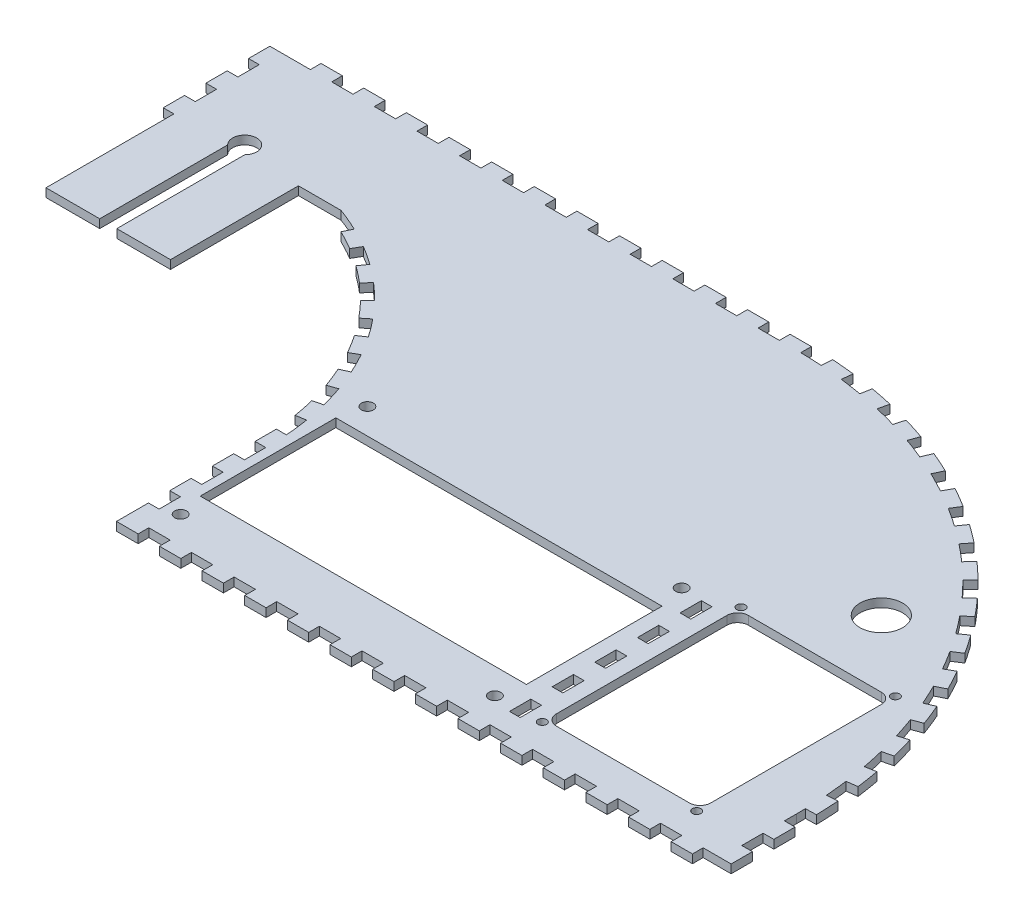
from build123d import *

# Parameters (mm, degrees)
MAIN_SHAPE_DEPTH                = 2.54
WIRE_SLOT_DEPTH                 = 2.54
SKETCH17_W                      = 97.155
SKETCH17_H                      = 40.386
SKETCH17_R                      = 1.27
SKETCH17_W_2                    = 3.175
SKETCH17_H_2                    = 6.35
SKETCH17_R_2                    = 1.778
SKETCH17_R_3                    = 6.35
DISPLAY_AND_CONTROLS_DEPTH      = 3.175
SKETCH19_W                      = 3.175
SKETCH19_H                      = 6.35
TEETH_NEAR_BACK_DEPTH           = 2.54
LPATTERN1_COUNT                 = 3
LPATTERN1_PITCH                 = 12.7
SKETCH20_W                      = 3.175
SKETCH20_H                      = 6.35
TEETH_SHORT_EXTERIOR_DEPTH      = 2.54
LPATTERN2_COUNT                 = 2
LPATTERN2_PITCH                 = 12.7
TEETH_EXTERIOR_CURVE_DEPTH      = 2.54
TEETH_ACROSS_BACK_DEPTH         = 2.54
LPATTERN3_COUNT                 = 12
LPATTERN3_PITCH                 = 12.7
SKETCH23_W                      = 3.175
SKETCH23_H                      = 6.35
TEETH_SHORT_INTERIOR_DEPTH      = 2.54
LPATTERN4_COUNT                 = 4
LPATTERN4_PITCH                 = 12.7
TEETH_INTERIOR_CURVE_DEPTH      = 2.54
SKETCH25_W                      = 6.4516
SKETCH25_H                      = 3.175
TEETH_CORNER_SNAGGLETOOTH_DEPTH = 2.54
SKETCH26_W                      = 6.35
SKETCH26_H                      = 3.175
TEETH_ACROSS_FRONT_DEPTH        = 2.54
LPATTERN5_COUNT                 = 13
LPATTERN5_PITCH                 = 12.7


with BuildPart() as part:
    # Sketch1 → main shape (new body)
    with BuildSketch(Plane(origin=(0, 0, 0), x_dir=(1, 0, 0), z_dir=(0, 1, 0))):
        with BuildLine():
            Line((254.731571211, -49.489780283), (254.731571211, -26.862706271))
            ThreePointArc((254.731571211, -26.862706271), (219.698386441, 57.714883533), (135.120796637, 92.748068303))
            Line((135.120796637, 92.748068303), (43.942, 92.748068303))
            Line((43.942, 92.748068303), (-18.542, 92.748068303))
            Line((-18.542, 92.748068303), (-18.542, 60.998068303))
            Line((-18.542, 60.998068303), (-18.542, 22.898068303))
            Line((-18.542, 22.898068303), (18.542, 22.898068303))
            Line((18.542, 22.898068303), (18.542, 60.998068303))
            Line((18.542, 60.998068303), (31.242, 60.998068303))
            ThreePointArc((31.242, 60.998068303), (67.466558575, 33.08647736), (81.188839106, -10.536619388))
            Line((81.188839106, -10.536619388), (81.188839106, -49.489780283))
            Line((81.188839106, -49.489780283), (89.223526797, -49.489780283))
            Line((89.223526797, -49.489780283), (241.56969011, -49.489780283))
            Line((241.56969011, -49.489780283), (254.731571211, -49.489780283))
        make_face()
    extrude(amount=MAIN_SHAPE_DEPTH)

    # Sketch13 → wire slot (cut)
    with BuildSketch(Plane(origin=(0, 2.54, 0), x_dir=(1, 0, 0), z_dir=(0, 1, 0))):
        with BuildLine():
            Line((-2.54, 22.898068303), (2.54, 22.898068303))
            Line((2.54, 22.898068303), (2.54, 60.998068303))
            ThreePointArc((2.54, 60.998068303), (0, 67.130170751), (-2.54, 60.998068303))
            Line((-2.54, 60.998068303), (-2.54, 22.898068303))
        make_face()
    extrude(amount=-WIRE_SLOT_DEPTH, mode=Mode.SUBTRACT)

    # Sketch17 → display and controls (cut)
    with BuildSketch(Plane(origin=(0, 2.54, 0), x_dir=(1, 0, 0), z_dir=(0, 1, 0))):
        with Locations((132.543718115, -13.476842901)):
            Rectangle(SKETCH17_W, SKETCH17_H)
        with BuildLine():
            Line((235.958598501, 17.185219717), (196.334598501, 17.185219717))
            ThreePointArc((196.334598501, 17.185219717), (194.08953447, 16.255283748), (193.159598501, 14.010219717))
            Line((193.159598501, 14.010219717), (193.159598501, -36.789780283))
            ThreePointArc((193.159598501, -36.789780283), (194.08953447, -39.034844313), (196.334598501, -39.964780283))
            Line((196.334598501, -39.964780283), (235.958598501, -39.964780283))
            ThreePointArc((235.958598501, -39.964780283), (238.203662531, -39.034844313), (239.133598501, -36.789780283))
            Line((239.133598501, -36.789780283), (239.133598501, 14.010219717))
            ThreePointArc((239.133598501, 14.010219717), (238.203662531, 16.255283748), (235.958598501, 17.185219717))
        make_face()
        with Locations(Location((193.159598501, 18.201219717, 0), (0, 0, 270))):
            Circle(SKETCH17_R)
        with Locations(Location((239.133598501, 18.201219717, 0), (0, 0, 270))):
            Circle(SKETCH17_R)
        with Locations(Location((193.159598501, -40.980780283, 0), (0, 0, 270))):
            Circle(SKETCH17_R)
        with Locations(Location((239.133598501, -40.980780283, 0), (0, 0, 270))):
            Circle(SKETCH17_R)
        with Locations((187.140408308, -39.964780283)):
            Rectangle(SKETCH17_W_2, SKETCH17_H_2)
        with Locations((187.140408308, -27.264780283)):
            Rectangle(SKETCH17_W_2, SKETCH17_H_2)
        with Locations((187.140408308, -14.564780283)):
            Rectangle(SKETCH17_W_2, SKETCH17_H_2)
        with Locations((187.140408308, -1.864780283)):
            Rectangle(SKETCH17_W_2, SKETCH17_H_2)
        with Locations((187.140408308, 10.835219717)):
            Rectangle(SKETCH17_W_2, SKETCH17_H_2)
        with Locations(Location((85.744218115, 14.336157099, 0), (0, 0, 270))):
            Circle(SKETCH17_R_2)
        with Locations(Location((179.343218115, 14.336157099, 0), (0, 0, 270))):
            Circle(SKETCH17_R_2)
        with Locations(Location((179.343218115, -41.289842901, 0), (0, 0, 270))):
            Circle(SKETCH17_R_2)
        with Locations(Location((85.744218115, -41.289842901, 0), (0, 0, 270))):
            Circle(SKETCH17_R_2)
        with Locations(Location((216.146598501, 37.005865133, 0), (0, 0, 270))):
            Circle(SKETCH17_R_3)
    extrude(amount=-DISPLAY_AND_CONTROLS_DEPTH, mode=Mode.SUBTRACT)

    # Sketch19 → teeth near back (add)
    with BuildSketch(Plane(origin=(0, 2.54, 0), x_dir=(1, 0, 0), z_dir=(0, 1, 0))):
        with Locations((-20.1295, 89.573068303)):
            Rectangle(SKETCH19_W, SKETCH19_H)
    teeth_near_back = extrude(amount=-TEETH_NEAR_BACK_DEPTH)

    # LPattern1: teeth near back ×3
    with Locations(*[(0, 0, i * LPATTERN1_PITCH) for i in range(1, LPATTERN1_COUNT)]):
        add(teeth_near_back)

    # Sketch20 → teeth short exterior (add)
    with BuildSketch(Plane(origin=(0, 2.54, 0), x_dir=(1, 0, 0), z_dir=(0, 1, 0))):
        with Locations((256.319071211, -46.314780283)):
            Rectangle(SKETCH20_W, SKETCH20_H)
    teeth_short_exterior = extrude(amount=-TEETH_SHORT_EXTERIOR_DEPTH)

    # LPattern2: teeth short exterior ×2
    with Locations(*[(0, 0, -i * LPATTERN2_PITCH) for i in range(1, LPATTERN2_COUNT)]):
        add(teeth_short_exterior)

    # Sketch21 → teeth exterior curve (add)
    with BuildSketch(Plane(origin=(0, 2.54, 0), x_dir=(1, 0, 0), z_dir=(0, 1, 0))):
        with BuildLine():
            Line((252.54392406, -24.210887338), (257.906571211, -24.089780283))
            ThreePointArc((257.906571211, -24.089780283), (257.783967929, -20.716002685), (257.568681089, -17.3468695))
            Line((257.568681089, -17.3468695), (252.22079123, -17.762472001))
            ThreePointArc((252.22079123, -17.762472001), (252.426675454, -20.984458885), (252.54392406, -24.210887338))
        make_face()
        with BuildLine():
            Line((251.543805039, -11.341555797), (256.860777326, -10.632713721))
            ThreePointArc((256.860777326, -10.632713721), (256.36869529, -7.292764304), (255.784999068, -3.967601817))
            Line((255.784999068, -3.967601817), (250.515011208, -4.967541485))
            ThreePointArc((250.515011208, -4.967541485), (251.0732146, -8.147478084), (251.543805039, -11.341555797))
        make_face()
        with BuildLine():
            ThreePointArc((247.415489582, 7.562937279), (248.31927011, 4.463458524), (249.137518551, 1.340309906))
            Line((249.137518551, 1.340309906), (254.344597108, 2.628325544))
            ThreePointArc((254.344597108, 2.628325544), (253.488979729, 5.894106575), (252.54392406, 9.135136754))
            Line((252.54392406, 9.135136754), (247.415489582, 7.562937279))
        make_face()
        with BuildLine():
            ThreePointArc((242.95966265, 19.677620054), (244.198104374, 16.696034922), (245.354127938, 13.681537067))
            Line((245.354127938, 13.681537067), (250.388421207, 15.533169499))
            ThreePointArc((250.388421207, 15.533169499), (249.179602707, 18.685337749), (247.884602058, 21.803090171))
            Line((247.884602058, 21.803090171), (242.95966265, 19.677620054))
        make_face()
        with BuildLine():
            ThreePointArc((237.201348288, 31.230184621), (238.759493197, 28.402504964), (240.239329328, 25.533067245))
            Line((240.239329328, 25.533067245), (245.040032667, 27.92595229))
            ThreePointArc((245.040032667, 27.92595229), (243.492613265, 30.926435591), (241.863308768, 33.883253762))
            Line((241.863308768, 33.883253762), (237.201348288, 31.230184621))
        make_face()
        with BuildLine():
            ThreePointArc((230.210095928, 42.081098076), (232.069124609, 39.441476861), (233.854899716, 36.751756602))
            Line((233.854899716, 36.751756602), (238.364029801, 39.656992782))
            ThreePointArc((238.364029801, 39.656992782), (236.496699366, 42.469551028), (234.552769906, 45.229722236))
            Line((234.552769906, 45.229722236), (230.210095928, 42.081098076))
        make_face()
        with BuildLine():
            ThreePointArc((222.07034654, 52.09930212), (224.20780548, 49.679620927), (226.27795081, 47.20210481))
            Line((226.27795081, 47.20210481), (230.441045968, 50.584602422))
            ThreePointArc((230.441045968, 50.584602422), (228.276358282, 53.175265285), (226.041282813, 55.705451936))
            Line((226.041282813, 55.705451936), (222.07034654, 52.09930212))
        make_face()
        with BuildLine():
            ThreePointArc((212.880412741, 61.163795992), (215.270485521, 58.993279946), (217.599997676, 56.757891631))
            Line((217.599997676, 56.757891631), (221.36677567, 60.576796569))
            ThreePointArc((221.36677567, 60.576796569), (218.930876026, 62.914273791), (216.431649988, 65.183916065))
            Line((216.431649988, 65.183916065), (212.880412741, 61.163795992))
        make_face()
        with BuildLine():
            ThreePointArc((202.751291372, 69.165097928), (205.365110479, 67.269962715), (207.925853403, 65.303701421))
            Line((207.925853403, 65.303701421), (211.250818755, 69.512888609))
            ThreePointArc((211.250818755, 69.512888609), (208.573128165, 71.568947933), (205.839937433, 73.55063289))
            Line((205.839937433, 73.55063289), (202.751291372, 69.165097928))
        make_face()
        with BuildLine():
            ThreePointArc((191.805322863, 76.006567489), (194.611318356, 74.409702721), (197.372363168, 72.736317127))
            Line((197.372363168, 72.736317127), (200.21535665, 77.284947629))
            ThreePointArc((200.21535665, 77.284947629), (197.328216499, 79.034755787), (194.394072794, 80.704548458))
            Line((194.394072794, 80.704548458), (191.805322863, 76.006567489))
        make_face()
        with BuildLine():
            ThreePointArc((180.174713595, 81.605572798), (183.138994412, 80.326265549), (186.066992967, 78.965966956))
            Line((186.066992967, 78.965966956), (188.39367665, 83.799102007))
            ThreePointArc((188.39367665, 83.799102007), (185.331958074, 85.22152466), (182.232300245, 86.55925714))
            Line((182.232300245, 86.55925714), (180.174713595, 81.605572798))
        make_face()
        with BuildLine():
            ThreePointArc((167.999939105, 85.894488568), (171.086702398, 84.948190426), (174.146290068, 83.917408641))
            Line((174.146290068, 83.917408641), (175.928562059, 88.976673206))
            ThreePointArc((175.928562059, 88.976673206), (172.729244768, 90.054530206), (169.501510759, 91.044045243))
            Line((169.501510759, 91.044045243), (167.999939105, 85.894488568))
        make_face()
        with BuildLine():
            ThreePointArc((155.428047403, 88.821512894), (158.600010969, 88.219653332), (161.754233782, 87.530838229))
            Line((161.754233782, 87.530838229), (162.970567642, 92.755126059))
            ThreePointArc((162.970567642, 92.755126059), (159.672293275, 93.475398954), (156.355467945, 94.104745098))
            Line((156.355467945, 94.104745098), (155.428047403, 88.821512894))
        make_face()
        with BuildLine():
            ThreePointArc((142.610882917, 90.351292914), (145.829735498, 90.101141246), (149.04049647, 89.762612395))
            Line((149.04049647, 89.762612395), (149.676201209, 95.088824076))
            ThreePointArc((149.676201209, 95.088824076), (146.318806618, 95.442813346), (142.952950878, 95.704389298))
            Line((142.952950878, 95.704389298), (142.610882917, 90.351292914))
        make_face()
    extrude(amount=-TEETH_EXTERIOR_CURVE_DEPTH)

    # Sketch22 → teeth across back (add)
    with BuildSketch(Plane(origin=(0, 2.54, 0), x_dir=(1, 0, 0), z_dir=(0, 1, 0))):
        Polygon((136.398481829, 92.504608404), (136.398481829, 95.923068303), (130.048481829, 95.923068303), (130.048481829, 92.748068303), align=None)
    teeth_across_back = extrude(amount=-TEETH_ACROSS_BACK_DEPTH)

    # LPattern3: teeth across back ×12
    with Locations(*[(-i * LPATTERN3_PITCH, 0, 0) for i in range(1, LPATTERN3_COUNT)]):
        add(teeth_across_back)

    # Sketch23 → teeth short interior (add)
    with BuildSketch(Plane(origin=(0, 2.54, 0), x_dir=(1, 0, 0), z_dir=(0, 1, 0))):
        with Locations((79.601339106, -46.314780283)):
            Rectangle(SKETCH23_W, SKETCH23_H)
    teeth_short_interior = extrude(amount=-TEETH_SHORT_INTERIOR_DEPTH)

    # LPattern4: teeth short interior ×4
    with Locations(*[(0, 0, -i * LPATTERN4_PITCH) for i in range(1, LPATTERN4_COUNT)]):
        add(teeth_short_interior)

    # Sketch24 → teeth interior curve (add)
    with BuildSketch(Plane(origin=(0, 2.54, 0), x_dir=(1, 0, 0), z_dir=(0, 1, 0))):
        with BuildLine():
            ThreePointArc((75.949909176, 7.557368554), (76.67161863, 4.444868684), (77.256875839, 1.303850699))
            Line((77.256875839, 1.303850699), (80.252161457, 1.794601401))
            ThreePointArc((80.252161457, 1.794601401), (79.642647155, 5.065804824), (78.891025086, 8.307308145))
            Line((78.891025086, 8.307308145), (75.949909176, 7.557368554))
        make_face()
        with BuildLine():
            ThreePointArc((71.72986304, 19.604740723), (72.981088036, 16.664850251), (74.102885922, 13.673180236))
            Line((74.102885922, 13.673180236), (76.967448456, 14.676601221))
            ThreePointArc((76.967448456, 14.676601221), (75.799155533, 17.792266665), (74.496071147, 20.854006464))
            Line((74.496071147, 20.854006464), (71.72986304, 19.604740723))
        make_face()
        with BuildLine():
            ThreePointArc((65.481924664, 30.736282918), (67.224647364, 28.058328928), (68.848900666, 25.306907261))
            Line((68.848900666, 25.306907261), (71.495701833, 26.792510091))
            ThreePointArc((71.495701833, 26.792510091), (69.804128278, 29.657969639), (67.989175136, 32.446916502))
            Line((67.989175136, 32.446916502), (65.481924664, 30.736282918))
        make_face()
        with BuildLine():
            ThreePointArc((57.395934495, 40.613768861), (59.577203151, 38.279119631), (61.654559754, 35.851546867))
            Line((61.654559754, 35.851546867), (64.00317784, 37.774192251))
            ThreePointArc((64.00317784, 37.774192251), (61.83972126, 40.302380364), (59.568045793, 42.733793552))
            Line((59.568045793, 42.733793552), (57.395934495, 40.613768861))
        make_face()
        with BuildLine():
            ThreePointArc((47.717581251, 48.93707614), (50.27111912, 47.016668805), (52.738459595, 44.986705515))
            Line((52.738459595, 44.986705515), (54.717533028, 47.287974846))
            ThreePointArc((54.717533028, 47.287974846), (52.147928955, 49.402073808), (49.488554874, 51.402076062))
            Line((49.488554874, 51.402076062), (47.717581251, 48.93707614))
        make_face()
        with BuildLine():
            ThreePointArc((36.7409368, 55.453305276), (39.589155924, 54.005490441), (42.37151138, 52.434816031))
            Line((42.37151138, 52.434816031), (43.920907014, 55.044786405))
            ThreePointArc((43.920907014, 55.044786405), (41.023231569, 56.68056039), (38.05696261, 58.188382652))
            Line((38.05696261, 58.188382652), (36.7409368, 55.453305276))
        make_face()
    extrude(amount=-TEETH_INTERIOR_CURVE_DEPTH)

    # Sketch25 → teeth corner snaggletooth (add)
    with BuildSketch(Plane(origin=(0, 2.54, 0), x_dir=(1, 0, 0), z_dir=(0, 1, 0))):
        with Locations((81.239639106, -51.077280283)):
            Rectangle(SKETCH25_W, SKETCH25_H)
    extrude(amount=-TEETH_CORNER_SNAGGLETOOTH_DEPTH)

    # Sketch26 → teeth across front (add)
    with BuildSketch(Plane(origin=(0, 2.54, 0), x_dir=(1, 0, 0), z_dir=(0, 1, 0))):
        with Locations((93.990439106, -51.077280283)):
            Rectangle(SKETCH26_W, SKETCH26_H)
    teeth_across_front = extrude(amount=-TEETH_ACROSS_FRONT_DEPTH)

    # LPattern5: teeth across front ×13
    with Locations(*[(i * LPATTERN5_PITCH, 0, 0) for i in range(1, LPATTERN5_COUNT)]):
        add(teeth_across_front)


solid = part.part
